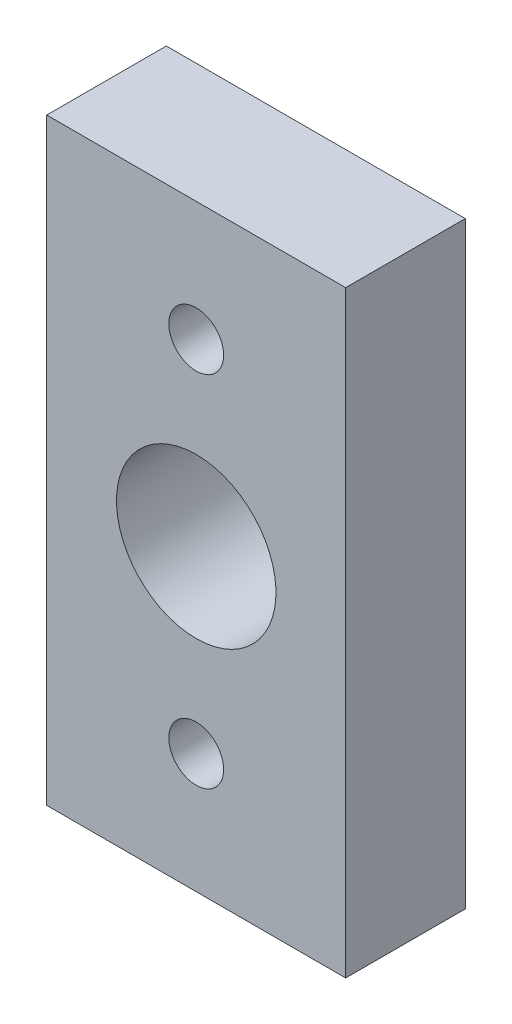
ISO-10303-21;
HEADER;
FILE_DESCRIPTION(('STEP AP214'),'2;1');
FILE_NAME('part.step','',(''),(''),'','','');
FILE_SCHEMA(('AUTOMOTIVE_DESIGN { 1 0 10303 214 1 1 1 1 }'));
ENDSEC;
DATA;
#1=APPLICATION_CONTEXT('core data for automotive mechanical design processes');
#2=APPLICATION_PROTOCOL_DEFINITION('international standard','automotive_design',2000,#1);
#3=PRODUCT_CONTEXT('',#1,'mechanical');
#4=PRODUCT('Part','Part','',(#3));
#5=PRODUCT_RELATED_PRODUCT_CATEGORY('part','',(#4));
#6=PRODUCT_DEFINITION_FORMATION('','',#4);
#7=PRODUCT_DEFINITION_CONTEXT('part definition',#1,'design');
#8=PRODUCT_DEFINITION('design','',#6,#7);
#9=PRODUCT_DEFINITION_SHAPE('','',#8);
#10=(LENGTH_UNIT() NAMED_UNIT(*) SI_UNIT(.MILLI.,.METRE.));
#11=(NAMED_UNIT(*) PLANE_ANGLE_UNIT() SI_UNIT($,.RADIAN.));
#12=(NAMED_UNIT(*) SI_UNIT($,.STERADIAN.) SOLID_ANGLE_UNIT());
#13=UNCERTAINTY_MEASURE_WITH_UNIT(LENGTH_MEASURE(1.E-05),#10,'distance_accuracy_value','');
#14=(GEOMETRIC_REPRESENTATION_CONTEXT(3) GLOBAL_UNCERTAINTY_ASSIGNED_CONTEXT((#13)) GLOBAL_UNIT_ASSIGNED_CONTEXT((#10,
#11,#12)) REPRESENTATION_CONTEXT('',''));
#15=CARTESIAN_POINT('',(0.,0.,0.));
#16=DIRECTION('',(0.,0.,1.));
#17=DIRECTION('',(1.,0.,0.));
#18=AXIS2_PLACEMENT_3D('',#15,#16,#17);
#19=CARTESIAN_POINT('',(15.,18.,-0.999999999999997));
#20=DIRECTION('',(0.,0.,-1.));
#21=DIRECTION('',(0.,1.,0.));
#22=AXIS2_PLACEMENT_3D('',#19,#20,#21);
#23=CYLINDRICAL_SURFACE('',#22,5.);
#24=CARTESIAN_POINT('',(15.,18.,-6.));
#25=DIRECTION('',(0.,0.,-1.));
#26=DIRECTION('',(0.,1.,0.));
#27=AXIS2_PLACEMENT_3D('',#24,#25,#26);
#28=CIRCLE('',#27,5.);
#29=CARTESIAN_POINT('',(15.,23.,-6.));
#30=VERTEX_POINT('',#29);
#31=EDGE_CURVE('E144',#30,#30,#28,.T.);
#32=ORIENTED_EDGE('',*,*,#31,.T.);
#33=EDGE_LOOP('',(#32));
#34=FACE_BOUND('',#33,.T.);
#35=CARTESIAN_POINT('',(15.,18.,-0.999999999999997));
#36=DIRECTION('',(0.,0.,-1.));
#37=DIRECTION('',(0.,1.,0.));
#38=AXIS2_PLACEMENT_3D('',#35,#36,#37);
#39=CIRCLE('',#38,5.);
#40=CARTESIAN_POINT('',(11.8057041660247,21.8466185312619,-0.999999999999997));
#41=VERTEX_POINT('',#40);
#42=CARTESIAN_POINT('',(10.0023531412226,18.1533814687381,-0.999999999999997));
#43=VERTEX_POINT('',#42);
#44=EDGE_CURVE('E121',#41,#43,#39,.T.);
#45=ORIENTED_EDGE('',*,*,#44,.F.);
#46=CARTESIAN_POINT('',(11.8057041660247,21.8466185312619,-0.999999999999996));
#47=CARTESIAN_POINT('',(11.7834305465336,21.8281239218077,-1.03414557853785));
#48=CARTESIAN_POINT('',(11.760610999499,21.8088454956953,-1.0674909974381));
#49=CARTESIAN_POINT('',(11.7141016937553,21.7687943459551,-1.13262108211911));
#50=CARTESIAN_POINT('',(11.6904122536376,21.7480221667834,-1.16440630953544));
#51=CARTESIAN_POINT('',(11.6183967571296,21.6835989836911,-1.2574521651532));
#52=CARTESIAN_POINT('',(11.5690759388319,21.6378022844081,-1.3164743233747));
#53=CARTESIAN_POINT('',(11.4688748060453,21.5406286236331,-1.42899049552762));
#54=CARTESIAN_POINT('',(11.4179879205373,21.4892248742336,-1.48245535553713));
#55=CARTESIAN_POINT('',(11.3158998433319,21.3812636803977,-1.58353477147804));
#56=CARTESIAN_POINT('',(11.2646985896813,21.3247051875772,-1.63114813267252));
#57=CARTESIAN_POINT('',(11.1213350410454,21.1584621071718,-1.7566977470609));
#58=CARTESIAN_POINT('',(11.029695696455,21.0429527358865,-1.82783578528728));
#59=CARTESIAN_POINT('',(10.8970401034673,20.8585797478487,-1.91767974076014));
#60=CARTESIAN_POINT('',(10.853666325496,20.7953447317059,-1.94479702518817));
#61=CARTESIAN_POINT('',(10.7689270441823,20.6653382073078,-1.99302030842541));
#62=CARTESIAN_POINT('',(10.7275607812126,20.5985680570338,-2.01412859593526));
#63=CARTESIAN_POINT('',(10.6380455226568,20.445991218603,-2.05393746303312));
#64=CARTESIAN_POINT('',(10.5905412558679,20.3593540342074,-2.07095136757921));
#65=CARTESIAN_POINT('',(10.5002481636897,20.1822279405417,-2.09398428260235));
#66=CARTESIAN_POINT('',(10.4574591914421,20.091739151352,-2.10000363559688));
#67=CARTESIAN_POINT('',(10.3709483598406,19.8935012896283,-2.09999577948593));
#68=CARTESIAN_POINT('',(10.328183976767,19.7853175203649,-2.09187463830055));
#69=CARTESIAN_POINT('',(10.251039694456,19.5686314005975,-2.0581395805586));
#70=CARTESIAN_POINT('',(10.2166603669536,19.4601290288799,-2.03252447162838));
#71=CARTESIAN_POINT('',(10.1565131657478,19.246199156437,-1.96327498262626));
#72=CARTESIAN_POINT('',(10.1307659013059,19.1407795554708,-1.91959802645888));
#73=CARTESIAN_POINT('',(10.0875033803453,18.9371386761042,-1.81478300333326));
#74=CARTESIAN_POINT('',(10.0699898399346,18.8389189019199,-1.7536413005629));
#75=CARTESIAN_POINT('',(10.0424888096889,18.6567186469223,-1.61803269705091));
#76=CARTESIAN_POINT('',(10.0322478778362,18.5723469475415,-1.54413953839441));
#77=CARTESIAN_POINT('',(10.0167440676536,18.416308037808,-1.38362432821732));
#78=CARTESIAN_POINT('',(10.0114755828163,18.3446265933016,-1.29701674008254));
#79=CARTESIAN_POINT('',(10.0065667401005,18.2572186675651,-1.1723252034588));
#80=CARTESIAN_POINT('',(10.005482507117,18.2350466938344,-1.13866923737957));
#81=CARTESIAN_POINT('',(10.0036705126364,18.1927109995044,-1.07019583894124));
#82=CARTESIAN_POINT('',(10.0029420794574,18.1725435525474,-1.03538072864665));
#83=CARTESIAN_POINT('',(10.0023531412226,18.1533814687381,-0.999999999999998));
#84=B_SPLINE_CURVE_WITH_KNOTS('',3,(#46,#47,#48,#49,#50,#51,#52,#53,#54,#55,#56,#57,#58,#59,#60,
#61,#62,#63,#64,#65,#66,#67,#68,#69,#70,#71,#72,#73,#74,#75,#76,#77,#78,#79,#80,#81,#82,#83),
.UNSPECIFIED.,.F.,.F.,(4,2,2,2,2,2,2,2,2,2,2,2,2,2,2,2,2,2,4),(0.,0.134259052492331,
0.268469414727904,0.536608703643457,0.806090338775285,1.07562690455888,1.56418087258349,
1.80793285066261,2.05159186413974,2.35161892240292,2.65163663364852,2.99992303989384,
3.34823318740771,3.69736910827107,4.04657776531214,4.3829242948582,4.7188911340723,
4.83979261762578,4.9604649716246),.UNSPECIFIED.);
#85=EDGE_CURVE('E21',#41,#43,#84,.T.);
#86=ORIENTED_EDGE('',*,*,#85,.T.);
#87=EDGE_LOOP('',(#45,#86));
#88=FACE_BOUND('',#87,.T.);
#89=ADVANCED_FACE('F17',(#34,#88),#23,.F.);
#90=CARTESIAN_POINT('',(15.,-18.,-1.));
#91=DIRECTION('',(0.,0.,-1.));
#92=DIRECTION('',(0.,1.,0.));
#93=AXIS2_PLACEMENT_3D('',#90,#91,#92);
#94=CYLINDRICAL_SURFACE('',#93,5.);
#95=CARTESIAN_POINT('',(15.,-18.,-6.));
#96=DIRECTION('',(0.,0.,-1.));
#97=DIRECTION('',(0.,1.,0.));
#98=AXIS2_PLACEMENT_3D('',#95,#96,#97);
#99=CIRCLE('',#98,5.);
#100=CARTESIAN_POINT('',(15.,-13.,-6.));
#101=VERTEX_POINT('',#100);
#102=EDGE_CURVE('E277',#101,#101,#99,.T.);
#103=ORIENTED_EDGE('',*,*,#102,.T.);
#104=EDGE_LOOP('',(#103));
#105=FACE_BOUND('',#104,.T.);
#106=CARTESIAN_POINT('',(15.,-18.,-1.));
#107=DIRECTION('',(0.,0.,-1.));
#108=DIRECTION('',(0.,1.,0.));
#109=AXIS2_PLACEMENT_3D('',#106,#107,#108);
#110=CIRCLE('',#109,5.);
#111=CARTESIAN_POINT('',(10.0023531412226,-18.1533814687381,-1.));
#112=VERTEX_POINT('',#111);
#113=CARTESIAN_POINT('',(11.8057041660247,-21.8466185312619,-1.));
#114=VERTEX_POINT('',#113);
#115=EDGE_CURVE('E370',#112,#114,#110,.T.);
#116=ORIENTED_EDGE('',*,*,#115,.F.);
#117=CARTESIAN_POINT('',(10.0023531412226,-18.1533814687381,-1.));
#118=CARTESIAN_POINT('',(10.0031940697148,-18.1807028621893,-1.05046474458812));
#119=CARTESIAN_POINT('',(10.0043182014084,-18.2101012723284,-1.09980010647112));
#120=CARTESIAN_POINT('',(10.0073494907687,-18.2728249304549,-1.19588974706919));
#121=CARTESIAN_POINT('',(10.0092567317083,-18.306150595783,-1.24264375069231));
#122=CARTESIAN_POINT('',(10.0140708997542,-18.3764975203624,-1.33323987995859));
#123=CARTESIAN_POINT('',(10.016977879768,-18.4135189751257,-1.37708185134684));
#124=CARTESIAN_POINT('',(10.024009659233,-18.4909536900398,-1.46152881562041));
#125=CARTESIAN_POINT('',(10.0281343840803,-18.5313667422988,-1.50213400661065));
#126=CARTESIAN_POINT('',(10.0426828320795,-18.6573701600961,-1.61877072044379));
#127=CARTESIAN_POINT('',(10.0552785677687,-18.7476835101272,-1.68957038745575));
#128=CARTESIAN_POINT('',(10.0877541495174,-18.9376045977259,-1.81501358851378));
#129=CARTESIAN_POINT('',(10.1076299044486,-19.0372070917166,-1.86966616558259));
#130=CARTESIAN_POINT('',(10.1551019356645,-19.2399872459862,-1.96073151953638));
#131=CARTESIAN_POINT('',(10.1825219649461,-19.3430410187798,-1.99751316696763));
#132=CARTESIAN_POINT('',(10.2454605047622,-19.5511739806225,-2.05430612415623));
#133=CARTESIAN_POINT('',(10.2809705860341,-19.656250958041,-2.07433478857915));
#134=CARTESIAN_POINT('',(10.3353654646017,-19.8008449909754,-2.09092796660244));
#135=CARTESIAN_POINT('',(10.3510331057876,-19.8409129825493,-2.09434711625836));
#136=CARTESIAN_POINT('',(10.3834345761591,-19.9207237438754,-2.09888349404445));
#137=CARTESIAN_POINT('',(10.4001678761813,-19.9604666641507,-2.10000185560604));
#138=CARTESIAN_POINT('',(10.474200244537,-20.1300699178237,-2.09999389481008));
#139=CARTESIAN_POINT('',(10.5366390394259,-20.2578710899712,-2.08786146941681));
#140=CARTESIAN_POINT('',(10.6704427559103,-20.5049631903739,-2.04228193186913));
#141=CARTESIAN_POINT('',(10.7418386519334,-20.6242222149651,-2.00875912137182));
#142=CARTESIAN_POINT('',(10.8901450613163,-20.8508398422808,-1.92369467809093));
#143=CARTESIAN_POINT('',(10.9670076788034,-20.9582848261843,-1.87229713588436));
#144=CARTESIAN_POINT('',(11.1240160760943,-21.1612000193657,-1.75369017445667));
#145=CARTESIAN_POINT('',(11.2041592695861,-21.2566794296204,-1.68649302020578));
#146=CARTESIAN_POINT('',(11.329524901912,-21.3959044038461,-1.5702542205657));
#147=CARTESIAN_POINT('',(11.3746492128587,-21.4439755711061,-1.52617308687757));
#148=CARTESIAN_POINT('',(11.4643905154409,-21.5360421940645,-1.43347117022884));
#149=CARTESIAN_POINT('',(11.5090076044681,-21.5800384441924,-1.38485127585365));
#150=CARTESIAN_POINT('',(11.5970226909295,-21.6637990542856,-1.28301646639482));
#151=CARTESIAN_POINT('',(11.6404203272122,-21.7035621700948,-1.22980020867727));
#152=CARTESIAN_POINT('',(11.7249953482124,-21.7785692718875,-1.11855252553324));
#153=CARTESIAN_POINT('',(11.7661708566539,-21.8138094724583,-1.06051713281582));
#154=CARTESIAN_POINT('',(11.8057041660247,-21.8466185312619,-1.));
#155=B_SPLINE_CURVE_WITH_KNOTS('',3,(#117,#118,#119,#120,#121,#122,#123,#124,#125,#126,#127,
#128,#129,#130,#131,#132,#133,#134,#135,#136,#137,#138,#139,#140,#141,#142,#143,#144,#145,#146,
#147,#148,#149,#150,#151,#152,#153,#154),.UNSPECIFIED.,.F.,.F.,(4,2,2,2,2,2,2,2,2,2,2,2,2,2,2,2,
2,2,4),(0.,0.172126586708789,0.344271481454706,0.516425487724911,0.688568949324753,
1.03305493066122,1.37734761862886,1.7141951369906,2.05069327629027,2.18010948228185,
2.30946191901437,2.73504859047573,3.16214978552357,3.58588494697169,4.00929224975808,
4.24702628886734,4.48471388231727,4.72247114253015,4.9604261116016),.UNSPECIFIED.);
#156=EDGE_CURVE('E125',#112,#114,#155,.T.);
#157=ORIENTED_EDGE('',*,*,#156,.T.);
#158=EDGE_LOOP('',(#116,#157));
#159=FACE_BOUND('',#158,.T.);
#160=ADVANCED_FACE('F279',(#105,#159),#94,.F.);
#161=CARTESIAN_POINT('',(0.,20.,0.));
#162=DIRECTION('',(-1.,0.,0.));
#163=DIRECTION('',(0.,0.,1.));
#164=AXIS2_PLACEMENT_3D('',#161,#162,#163);
#165=CYLINDRICAL_SURFACE('',#164,2.1);
#166=CARTESIAN_POINT('',(12.4000000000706,20.,0.));
#167=DIRECTION('',(-1.,0.,0.));
#168=DIRECTION('',(0.,0.,1.));
#169=AXIS2_PLACEMENT_3D('',#166,#167,#168);
#170=CIRCLE('',#169,2.09999999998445);
#171=CARTESIAN_POINT('',(12.4000000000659,21.8466185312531,-0.999999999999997));
#172=VERTEX_POINT('',#171);
#173=CARTESIAN_POINT('',(12.4000000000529,20.,2.09999999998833));
#174=VERTEX_POINT('',#173);
#175=EDGE_CURVE('E155',#172,#174,#170,.F.);
#176=ORIENTED_EDGE('',*,*,#175,.T.);
#177=CARTESIAN_POINT('',(12.4000000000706,20.,0.));
#178=DIRECTION('',(-1.,0.,0.));
#179=DIRECTION('',(0.,0.,1.));
#180=AXIS2_PLACEMENT_3D('',#177,#178,#179);
#181=CIRCLE('',#180,2.09999999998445);
#182=CARTESIAN_POINT('',(12.4000000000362,18.8958236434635,1.78627953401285));
#183=VERTEX_POINT('',#182);
#184=EDGE_CURVE('E346',#174,#183,#181,.F.);
#185=ORIENTED_EDGE('',*,*,#184,.T.);
#186=CARTESIAN_POINT('',(12.4000000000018,18.8958236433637,1.78627953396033));
#187=CARTESIAN_POINT('',(12.3847910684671,18.8517040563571,1.75902403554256));
#188=CARTESIAN_POINT('',(12.3710813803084,18.8082457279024,1.72988584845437));
#189=CARTESIAN_POINT('',(12.3464169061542,18.7231509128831,1.66805433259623));
#190=CARTESIAN_POINT('',(12.3354605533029,18.6815134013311,1.63536304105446));
#191=CARTESIAN_POINT('',(12.3160643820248,18.600599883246,1.56668189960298));
#192=CARTESIAN_POINT('',(12.3076189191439,18.5613187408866,1.53069968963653));
#193=CARTESIAN_POINT('',(12.2929040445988,18.4854131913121,1.45563715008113));
#194=CARTESIAN_POINT('',(12.2866347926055,18.4487889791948,1.41655659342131));
#195=CARTESIAN_POINT('',(12.2706198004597,18.3435343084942,1.29520218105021));
#196=CARTESIAN_POINT('',(12.2636240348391,18.2793272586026,1.20865080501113));
#197=CARTESIAN_POINT('',(12.2543497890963,18.1649575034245,1.0267214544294));
#198=CARTESIAN_POINT('',(12.2520637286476,18.1147723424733,0.931357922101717));
#199=CARTESIAN_POINT('',(12.2505915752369,18.0586024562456,0.801345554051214));
#200=CARTESIAN_POINT('',(12.2503545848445,18.0457811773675,0.769547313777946));
#201=CARTESIAN_POINT('',(12.2500594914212,18.0217071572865,0.705360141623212));
#202=CARTESIAN_POINT('',(12.2500014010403,18.0104545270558,0.672971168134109));
#203=CARTESIAN_POINT('',(12.2499951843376,17.9640656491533,0.528057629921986));
#204=CARTESIAN_POINT('',(12.2506601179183,17.9375603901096,0.412615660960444));
#205=CARTESIAN_POINT('',(12.2516142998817,17.9042831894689,0.178768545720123));
#206=CARTESIAN_POINT('',(12.2519028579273,17.8975474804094,0.0603583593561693));
#207=CARTESIAN_POINT('',(12.251695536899,17.9035116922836,-0.156605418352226));
#208=CARTESIAN_POINT('',(12.2513198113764,17.913223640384,-0.255250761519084));
#209=CARTESIAN_POINT('',(12.2504712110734,17.9464266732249,-0.450089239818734));
#210=CARTESIAN_POINT('',(12.2499984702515,17.9698988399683,-0.546285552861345));
#211=CARTESIAN_POINT('',(12.2500010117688,18.0199087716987,-0.702501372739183));
#212=CARTESIAN_POINT('',(12.2502094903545,18.0427173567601,-0.763741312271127));
#213=CARTESIAN_POINT('',(12.2514879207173,18.0939159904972,-0.883801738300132));
#214=CARTESIAN_POINT('',(12.252557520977,18.1223037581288,-0.942623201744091));
#215=CARTESIAN_POINT('',(12.2542807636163,18.1533814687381,-0.999999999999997));
#216=B_SPLINE_CURVE_WITH_KNOTS('',3,(#186,#187,#188,#189,#190,#191,#192,#193,#194,#195,#196,
#197,#198,#199,#200,#201,#202,#203,#204,#205,#206,#207,#208,#209,#210,#211,#212,#213,#214,#215),
.UNSPECIFIED.,.F.,.F.,(4,2,2,2,2,2,2,2,2,2,2,2,2,2,4),(0.,0.162056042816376,0.324019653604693,
0.485616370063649,0.647224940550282,0.969676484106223,1.29160863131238,1.39443809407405,
1.49727482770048,1.85074574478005,2.20486408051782,2.50128318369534,2.79729571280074,
2.99307706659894,3.18877854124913),.UNSPECIFIED.);
#217=CARTESIAN_POINT('',(12.2542807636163,18.1533814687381,-0.999999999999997));
#218=VERTEX_POINT('',#217);
#219=EDGE_CURVE('E141',#183,#218,#216,.T.);
#220=ORIENTED_EDGE('',*,*,#219,.T.);
#221=DIRECTION('',(1.,0.,0.));
#222=VECTOR('',#221,1.);
#223=CARTESIAN_POINT('',(15.,18.1533814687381,-0.999999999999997));
#224=LINE('',#223,#222);
#225=EDGE_CURVE('E130',#43,#218,#224,.T.);
#226=ORIENTED_EDGE('',*,*,#225,.F.);
#227=ORIENTED_EDGE('',*,*,#85,.F.);
#228=DIRECTION('',(1.,0.,0.));
#229=VECTOR('',#228,1.);
#230=CARTESIAN_POINT('',(15.,21.8466185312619,-0.999999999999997));
#231=LINE('',#230,#229);
#232=EDGE_CURVE('E133',#172,#41,#231,.F.);
#233=ORIENTED_EDGE('',*,*,#232,.F.);
#234=EDGE_LOOP('',(#176,#185,#220,#226,#227,#233));
#235=FACE_BOUND('',#234,.T.);
#236=CARTESIAN_POINT('',(0.,20.,0.));
#237=DIRECTION('',(-1.,0.,0.));
#238=DIRECTION('',(0.,0.,1.));
#239=AXIS2_PLACEMENT_3D('',#236,#237,#238);
#240=CIRCLE('',#239,2.1);
#241=CARTESIAN_POINT('',(0.,20.,2.09999999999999));
#242=VERTEX_POINT('',#241);
#243=EDGE_CURVE('E323',#242,#242,#240,.T.);
#244=ORIENTED_EDGE('',*,*,#243,.T.);
#245=EDGE_LOOP('',(#244));
#246=FACE_BOUND('',#245,.T.);
#247=ADVANCED_FACE('F137',(#235,#246),#165,.F.);
#248=CARTESIAN_POINT('',(0.,-20.,0.));
#249=DIRECTION('',(-1.,0.,0.));
#250=DIRECTION('',(0.,0.,1.));
#251=AXIS2_PLACEMENT_3D('',#248,#249,#250);
#252=CYLINDRICAL_SURFACE('',#251,2.1);
#253=CARTESIAN_POINT('',(12.4000000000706,-20.,0.));
#254=DIRECTION('',(-1.,0.,0.));
#255=DIRECTION('',(0.,0.,1.));
#256=AXIS2_PLACEMENT_3D('',#253,#254,#255);
#257=CIRCLE('',#256,2.09999999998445);
#258=CARTESIAN_POINT('',(12.4000000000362,-18.8958236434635,1.78627953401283));
#259=VERTEX_POINT('',#258);
#260=CARTESIAN_POINT('',(12.4000000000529,-20.,2.09999999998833));
#261=VERTEX_POINT('',#260);
#262=EDGE_CURVE('E352',#259,#261,#257,.F.);
#263=ORIENTED_EDGE('',*,*,#262,.T.);
#264=CARTESIAN_POINT('',(12.4000000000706,-20.,0.));
#265=DIRECTION('',(-1.,0.,0.));
#266=DIRECTION('',(0.,0.,1.));
#267=AXIS2_PLACEMENT_3D('',#264,#265,#266);
#268=CIRCLE('',#267,2.09999999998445);
#269=CARTESIAN_POINT('',(12.4000000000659,-21.8466185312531,-1.));
#270=VERTEX_POINT('',#269);
#271=EDGE_CURVE('E148',#261,#270,#268,.F.);
#272=ORIENTED_EDGE('',*,*,#271,.T.);
#273=DIRECTION('',(1.,0.,0.));
#274=VECTOR('',#273,1.);
#275=CARTESIAN_POINT('',(15.,-21.8466185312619,-1.));
#276=LINE('',#275,#274);
#277=EDGE_CURVE('E371',#114,#270,#276,.T.);
#278=ORIENTED_EDGE('',*,*,#277,.F.);
#279=ORIENTED_EDGE('',*,*,#156,.F.);
#280=DIRECTION('',(1.,0.,0.));
#281=VECTOR('',#280,1.);
#282=CARTESIAN_POINT('',(15.,-18.1533814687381,-1.));
#283=LINE('',#282,#281);
#284=CARTESIAN_POINT('',(12.2542807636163,-18.1533814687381,-1.));
#285=VERTEX_POINT('',#284);
#286=EDGE_CURVE('E367',#285,#112,#283,.F.);
#287=ORIENTED_EDGE('',*,*,#286,.F.);
#288=CARTESIAN_POINT('',(12.2542807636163,-18.1533814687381,-1.));
#289=CARTESIAN_POINT('',(12.2525574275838,-18.1223281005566,-0.942662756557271));
#290=CARTESIAN_POINT('',(12.2514888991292,-18.0939614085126,-0.883893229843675));
#291=CARTESIAN_POINT('',(12.2502105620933,-18.0427544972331,-0.763843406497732));
#292=CARTESIAN_POINT('',(12.2500024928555,-18.0199255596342,-0.702558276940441));
#293=CARTESIAN_POINT('',(12.2499954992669,-17.9640253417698,-0.527930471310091));
#294=CARTESIAN_POINT('',(12.2506611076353,-17.9375147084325,-0.412416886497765));
#295=CARTESIAN_POINT('',(12.2516148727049,-17.9042746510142,-0.178585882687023));
#296=CARTESIAN_POINT('',(12.2519029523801,-17.8975492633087,-0.0602678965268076));
#297=CARTESIAN_POINT('',(12.2516954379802,-17.9035107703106,0.156550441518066));
#298=CARTESIAN_POINT('',(12.251319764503,-17.913216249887,0.255141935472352));
#299=CARTESIAN_POINT('',(12.2504722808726,-17.9463939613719,0.449962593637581));
#300=CARTESIAN_POINT('',(12.2500004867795,-17.9698638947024,0.546192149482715));
#301=CARTESIAN_POINT('',(12.249999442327,-18.0345250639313,0.748140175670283));
#302=CARTESIAN_POINT('',(12.2506174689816,-18.0777993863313,0.853199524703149));
#303=CARTESIAN_POINT('',(12.2554608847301,-18.1807058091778,1.05499770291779));
#304=CARTESIAN_POINT('',(12.2596894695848,-18.2403523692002,1.15172907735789));
#305=CARTESIAN_POINT('',(12.2747911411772,-18.3745440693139,1.33444745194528));
#306=CARTESIAN_POINT('',(12.2856913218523,-18.4491491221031,1.42038890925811));
#307=CARTESIAN_POINT('',(12.3093475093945,-18.5697080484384,1.53865208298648));
#308=CARTESIAN_POINT('',(12.3184410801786,-18.6113020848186,1.57627425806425));
#309=CARTESIAN_POINT('',(12.3394127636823,-18.696931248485,1.64775927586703));
#310=CARTESIAN_POINT('',(12.3512888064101,-18.7409645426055,1.68162488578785));
#311=CARTESIAN_POINT('',(12.3700805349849,-18.8039771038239,1.72627351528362));
#312=CARTESIAN_POINT('',(12.3757091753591,-18.822173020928,1.73873734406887));
#313=CARTESIAN_POINT('',(12.3874712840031,-18.8588151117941,1.76300278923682));
#314=CARTESIAN_POINT('',(12.3936042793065,-18.877261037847,1.77480500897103));
#315=CARTESIAN_POINT('',(12.4000000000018,-18.8958236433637,1.78627953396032));
#316=B_SPLINE_CURVE_WITH_KNOTS('',3,(#288,#289,#290,#291,#292,#293,#294,#295,#296,#297,#298,
#299,#300,#301,#302,#303,#304,#305,#306,#307,#308,#309,#310,#311,#312,#313,#314,#315),
.UNSPECIFIED.,.F.,.F.,(4,2,2,2,2,2,2,2,2,2,2,2,2,4),(0.,0.195543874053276,0.391482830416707,
0.74524137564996,1.09907208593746,1.39531263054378,1.69150371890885,2.03083145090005,
2.37045983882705,2.71147672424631,2.88173194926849,3.05186091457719,3.12013472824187,
3.18834523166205),.UNSPECIFIED.);
#317=EDGE_CURVE('E200',#285,#259,#316,.T.);
#318=ORIENTED_EDGE('',*,*,#317,.T.);
#319=EDGE_LOOP('',(#263,#272,#278,#279,#287,#318));
#320=FACE_BOUND('',#319,.T.);
#321=CARTESIAN_POINT('',(0.,-20.,0.));
#322=DIRECTION('',(-1.,0.,0.));
#323=DIRECTION('',(0.,0.,1.));
#324=AXIS2_PLACEMENT_3D('',#321,#322,#323);
#325=CIRCLE('',#324,2.1);
#326=CARTESIAN_POINT('',(0.,-20.,2.09999999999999));
#327=VERTEX_POINT('',#326);
#328=EDGE_CURVE('E326',#327,#327,#325,.T.);
#329=ORIENTED_EDGE('',*,*,#328,.T.);
#330=EDGE_LOOP('',(#329));
#331=FACE_BOUND('',#330,.T.);
#332=ADVANCED_FACE('F266',(#320,#331),#252,.F.);
#333=CARTESIAN_POINT('',(30.,30.,-6.));
#334=DIRECTION('',(0.,0.,1.));
#335=DIRECTION('',(0.,-1.,0.));
#336=AXIS2_PLACEMENT_3D('',#333,#334,#335);
#337=PLANE('',#336);
#338=DIRECTION('',(1.,0.,0.));
#339=VECTOR('',#338,1.);
#340=CARTESIAN_POINT('',(30.,30.,-6.));
#341=LINE('',#340,#339);
#342=CARTESIAN_POINT('',(0.,30.,-6.));
#343=VERTEX_POINT('',#342);
#344=CARTESIAN_POINT('',(30.,30.,-6.));
#345=VERTEX_POINT('',#344);
#346=EDGE_CURVE('E317',#343,#345,#341,.T.);
#347=ORIENTED_EDGE('',*,*,#346,.T.);
#348=DIRECTION('',(0.,1.,0.));
#349=VECTOR('',#348,1.);
#350=CARTESIAN_POINT('',(30.,0.,-6.));
#351=LINE('',#350,#349);
#352=CARTESIAN_POINT('',(30.,-30.,-6.));
#353=VERTEX_POINT('',#352);
#354=EDGE_CURVE('E319',#353,#345,#351,.T.);
#355=ORIENTED_EDGE('',*,*,#354,.F.);
#356=DIRECTION('',(1.,0.,0.));
#357=VECTOR('',#356,1.);
#358=CARTESIAN_POINT('',(30.,-30.,-6.));
#359=LINE('',#358,#357);
#360=CARTESIAN_POINT('',(0.,-30.,-6.));
#361=VERTEX_POINT('',#360);
#362=EDGE_CURVE('E327',#353,#361,#359,.F.);
#363=ORIENTED_EDGE('',*,*,#362,.T.);
#364=DIRECTION('',(0.,1.,0.));
#365=VECTOR('',#364,1.);
#366=CARTESIAN_POINT('',(0.,0.,-6.));
#367=LINE('',#366,#365);
#368=EDGE_CURVE('E333',#361,#343,#367,.T.);
#369=ORIENTED_EDGE('',*,*,#368,.T.);
#370=EDGE_LOOP('',(#347,#355,#363,#369));
#371=FACE_BOUND('',#370,.T.);
#372=ORIENTED_EDGE('',*,*,#31,.F.);
#373=EDGE_LOOP('',(#372));
#374=FACE_BOUND('',#373,.T.);
#375=ORIENTED_EDGE('',*,*,#102,.F.);
#376=EDGE_LOOP('',(#375));
#377=FACE_BOUND('',#376,.T.);
#378=CARTESIAN_POINT('',(15.,0.,-6.));
#379=DIRECTION('',(0.,0.,-1.));
#380=DIRECTION('',(0.,1.,0.));
#381=AXIS2_PLACEMENT_3D('',#378,#379,#380);
#382=CIRCLE('',#381,8.);
#383=CARTESIAN_POINT('',(15.,8.,-6.));
#384=VERTEX_POINT('',#383);
#385=EDGE_CURVE('E315',#384,#384,#382,.F.);
#386=ORIENTED_EDGE('',*,*,#385,.T.);
#387=EDGE_LOOP('',(#386));
#388=FACE_BOUND('',#387,.T.);
#389=ADVANCED_FACE('F263',(#371,#374,#377,#388),#337,.F.);
#390=CARTESIAN_POINT('',(15.,18.,-0.999999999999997));
#391=DIRECTION('',(0.,0.,-1.));
#392=DIRECTION('',(0.,1.,0.));
#393=AXIS2_PLACEMENT_3D('',#390,#391,#392);
#394=PLANE('',#393);
#395=ORIENTED_EDGE('',*,*,#232,.T.);
#396=ORIENTED_EDGE('',*,*,#44,.T.);
#397=ORIENTED_EDGE('',*,*,#225,.T.);
#398=CARTESIAN_POINT('',(15.,18.,-0.999999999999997));
#399=DIRECTION('',(0.,0.,1.));
#400=DIRECTION('',(1.,0.,0.));
#401=AXIS2_PLACEMENT_3D('',#398,#399,#400);
#402=CIRCLE('',#401,2.75);
#403=CARTESIAN_POINT('',(13.0601733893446,19.9492493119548,-0.999999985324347));
#404=VERTEX_POINT('',#403);
#405=EDGE_CURVE('E331',#218,#404,#402,.T.);
#406=ORIENTED_EDGE('',*,*,#405,.T.);
#407=CARTESIAN_POINT('',(13.0601733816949,19.9492493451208,-1.00000000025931));
#408=CARTESIAN_POINT('',(13.0604310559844,19.9577058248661,-1.00000000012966));
#409=CARTESIAN_POINT('',(13.0606243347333,19.9661632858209,-1.00000000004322));
#410=CARTESIAN_POINT('',(13.0608821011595,19.9830801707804,-0.999999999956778));
#411=CARTESIAN_POINT('',(13.0609465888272,19.9915395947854,-0.999999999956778));
#412=CARTESIAN_POINT('',(13.0609466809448,20.,-0.999999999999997));
#413=B_SPLINE_CURVE_WITH_KNOTS('',3,(#407,#408,#409,#410,#411,#412),.UNSPECIFIED.,.F.,.F.,(4,2,
4),(0.,0.0253790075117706,0.0507580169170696),.UNSPECIFIED.);
#414=CARTESIAN_POINT('',(13.0609466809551,20.,-0.999999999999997));
#415=VERTEX_POINT('',#414);
#416=EDGE_CURVE('E134',#404,#415,#413,.T.);
#417=ORIENTED_EDGE('',*,*,#416,.T.);
#418=CARTESIAN_POINT('',(13.0609466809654,20.,-0.999999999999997));
#419=CARTESIAN_POINT('',(13.0609921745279,20.0458391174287,-0.999999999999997));
#420=CARTESIAN_POINT('',(13.0590528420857,20.0916511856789,-0.999999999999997));
#421=CARTESIAN_POINT('',(13.0515717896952,20.1828832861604,-0.999999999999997));
#422=CARTESIAN_POINT('',(13.046037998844,20.2283039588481,-0.999999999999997));
#423=CARTESIAN_POINT('',(13.0318002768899,20.3181899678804,-0.999999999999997));
#424=CARTESIAN_POINT('',(13.0231269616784,20.3626602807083,-0.999999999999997));
#425=CARTESIAN_POINT('',(13.0031215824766,20.4510085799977,-0.999999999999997));
#426=CARTESIAN_POINT('',(12.9917883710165,20.4948863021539,-0.999999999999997));
#427=CARTESIAN_POINT('',(12.9632578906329,20.5950500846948,-0.999999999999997));
#428=CARTESIAN_POINT('',(12.9453204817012,20.6511233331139,-0.999999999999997));
#429=CARTESIAN_POINT('',(12.906751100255,20.7623437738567,-0.999999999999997));
#430=CARTESIAN_POINT('',(12.886118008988,20.817490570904,-0.999999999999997));
#431=CARTESIAN_POINT('',(12.8428217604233,20.9271108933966,-0.999999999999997));
#432=CARTESIAN_POINT('',(12.8201543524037,20.9815827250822,-0.999999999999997));
#433=CARTESIAN_POINT('',(12.7733377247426,21.0898870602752,-0.999999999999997));
#434=CARTESIAN_POINT('',(12.7491883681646,21.1437195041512,-0.999999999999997));
#435=CARTESIAN_POINT('',(12.6990697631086,21.2523969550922,-0.999999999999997));
#436=CARTESIAN_POINT('',(12.6730682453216,21.3072270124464,-0.999999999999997));
#437=CARTESIAN_POINT('',(12.6201669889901,21.4164549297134,-0.999999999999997));
#438=CARTESIAN_POINT('',(12.5932671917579,21.4708527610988,-0.999999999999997));
#439=CARTESIAN_POINT('',(12.5389402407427,21.5789735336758,-0.999999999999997));
#440=CARTESIAN_POINT('',(12.511517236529,21.6326985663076,-0.999999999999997));
#441=CARTESIAN_POINT('',(12.45613062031,21.7398583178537,-0.999999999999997));
#442=CARTESIAN_POINT('',(12.4281670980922,21.7932930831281,-0.999999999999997));
#443=CARTESIAN_POINT('',(12.4000000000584,21.8466185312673,-0.999999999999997));
#444=B_SPLINE_CURVE_WITH_KNOTS('',3,(#418,#419,#420,#421,#422,#423,#424,#425,#426,#427,#428,
#429,#430,#431,#432,#433,#434,#435,#436,#437,#438,#439,#440,#441,#442,#443),.UNSPECIFIED.,.F.,
.F.,(4,2,2,2,2,2,2,2,2,2,2,2,4),(0.,0.137433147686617,0.274564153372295,0.410392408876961,
0.546279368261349,0.722798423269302,0.899390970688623,1.07636150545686,1.2533484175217,
1.43538653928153,1.61743657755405,1.79839066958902,1.97931495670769),.UNSPECIFIED.);
#445=EDGE_CURVE('E158',#415,#172,#444,.T.);
#446=ORIENTED_EDGE('',*,*,#445,.T.);
#447=EDGE_LOOP('',(#395,#396,#397,#406,#417,#446));
#448=FACE_BOUND('',#447,.T.);
#449=ADVANCED_FACE('F128',(#448),#394,.T.);
#450=CARTESIAN_POINT('',(13.0598591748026,20.,0.));
#451=DIRECTION('',(-1.,0.,0.));
#452=DIRECTION('',(0.,-1.,0.));
#453=AXIS2_PLACEMENT_3D('',#450,#451,#452);
#454=CONICAL_SURFACE('',#453,1.00180991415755,1.02974425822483);
#455=DIRECTION('',(0.515038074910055,0.,0.857167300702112));
#456=VECTOR('',#455,1.);
#457=CARTESIAN_POINT('',(-299815.787087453,20.0000000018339,-499000.));
#458=LINE('',#457,#456);
#459=CARTESIAN_POINT('',(13.1125413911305,20.0000000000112,-0.914131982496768));
#460=VERTEX_POINT('',#459);
#461=EDGE_CURVE('E157',#460,#415,#458,.F.);
#462=ORIENTED_EDGE('',*,*,#461,.T.);
#463=ORIENTED_EDGE('',*,*,#416,.F.);
#464=CARTESIAN_POINT('',(13.0601733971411,19.9492492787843,-0.999999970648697));
#465=CARTESIAN_POINT('',(13.0689290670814,19.9579589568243,-0.985854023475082));
#466=CARTESIAN_POINT('',(13.0776708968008,19.9665430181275,-0.97162539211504));
#467=CARTESIAN_POINT('',(13.0951268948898,19.9834599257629,-0.943002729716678));
#468=CARTESIAN_POINT('',(13.1038410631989,19.9917927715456,-0.928608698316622));
#469=CARTESIAN_POINT('',(13.1125413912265,20.0000000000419,-0.914131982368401));
#470=B_SPLINE_CURVE_WITH_KNOTS('',3,(#464,#465,#466,#467,#468,#469),.UNSPECIFIED.,.F.,.F.,(4,2,
4),(0.,0.0563297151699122,0.112659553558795),.UNSPECIFIED.);
#471=EDGE_CURVE('E332',#404,#460,#470,.T.);
#472=ORIENTED_EDGE('',*,*,#471,.T.);
#473=EDGE_LOOP('',(#462,#463,#472));
#474=FACE_BOUND('',#473,.T.);
#475=ADVANCED_FACE('F236',(#474),#454,.F.);
#476=CARTESIAN_POINT('',(12.4000000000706,20.,0.));
#477=DIRECTION('',(-1.,0.,0.));
#478=DIRECTION('',(0.,0.,1.));
#479=AXIS2_PLACEMENT_3D('',#476,#477,#478);
#480=CONICAL_SURFACE('',#479,2.09999999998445,1.02974425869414);
#481=CARTESIAN_POINT('',(13.1125413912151,20.0000000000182,-0.914131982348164));
#482=CARTESIAN_POINT('',(13.1332503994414,20.0195461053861,-0.879637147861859));
#483=CARTESIAN_POINT('',(13.1538800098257,20.0384041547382,-0.844702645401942));
#484=CARTESIAN_POINT('',(13.1948175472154,20.0747443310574,-0.77388174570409));
#485=CARTESIAN_POINT('',(13.2151251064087,20.0922249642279,-0.737994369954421));
#486=CARTESIAN_POINT('',(13.2555654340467,20.1260655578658,-0.664624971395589));
#487=CARTESIAN_POINT('',(13.2756887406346,20.1424001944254,-0.627125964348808));
#488=CARTESIAN_POINT('',(13.3150195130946,20.1734693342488,-0.55102654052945));
#489=CARTESIAN_POINT('',(13.3342274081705,20.1882045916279,-0.512426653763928));
#490=CARTESIAN_POINT('',(13.3732204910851,20.2173720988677,-0.429442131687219));
#491=CARTESIAN_POINT('',(13.392830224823,20.2315863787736,-0.384893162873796));
#492=CARTESIAN_POINT('',(13.4195637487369,20.250520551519,-0.31640268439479));
#493=CARTESIAN_POINT('',(13.4280208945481,20.2564293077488,-0.293318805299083));
#494=CARTESIAN_POINT('',(13.4436814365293,20.2672587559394,-0.246512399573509));
#495=CARTESIAN_POINT('',(13.4508853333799,20.2721798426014,-0.222790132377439));
#496=CARTESIAN_POINT('',(13.4662033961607,20.2825615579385,-0.164626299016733));
#497=CARTESIAN_POINT('',(13.4734566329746,20.2873999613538,-0.129818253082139));
#498=CARTESIAN_POINT('',(13.4805818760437,20.2921335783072,-0.0769646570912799));
#499=CARTESIAN_POINT('',(13.4823314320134,20.2932909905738,-0.0592792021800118));
#500=CARTESIAN_POINT('',(13.4844710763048,20.2947056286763,-0.0237872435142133));
#501=CARTESIAN_POINT('',(13.484861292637,20.2949629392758,-0.00598075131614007));
#502=CARTESIAN_POINT('',(13.4842483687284,20.2945581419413,0.0296312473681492));
#503=CARTESIAN_POINT('',(13.4832425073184,20.2938942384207,0.047436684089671));
#504=CARTESIAN_POINT('',(13.4799122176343,20.291688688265,0.0828699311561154));
#505=CARTESIAN_POINT('',(13.4775874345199,20.2901468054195,0.100497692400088));
#506=CARTESIAN_POINT('',(13.4717643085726,20.28626502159,0.135566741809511));
#507=CARTESIAN_POINT('',(13.468259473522,20.2839207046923,0.153006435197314));
#508=CARTESIAN_POINT('',(13.4602723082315,20.2785438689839,0.187547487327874));
#509=CARTESIAN_POINT('',(13.4557899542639,20.2755113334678,0.204648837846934));
#510=CARTESIAN_POINT('',(13.4378731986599,20.2632950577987,0.266924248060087));
#511=CARTESIAN_POINT('',(13.422038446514,20.2523284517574,0.311050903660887));
#512=CARTESIAN_POINT('',(13.3874136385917,20.2276719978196,0.39735530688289));
#513=CARTESIAN_POINT('',(13.3686161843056,20.2139753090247,0.439527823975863));
#514=CARTESIAN_POINT('',(13.3293147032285,20.1844720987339,0.522538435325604));
#515=CARTESIAN_POINT('',(13.3088039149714,20.1686570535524,0.563370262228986));
#516=CARTESIAN_POINT('',(13.2668311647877,20.1352626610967,0.643806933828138));
#517=CARTESIAN_POINT('',(13.2453689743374,20.1176828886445,0.683411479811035));
#518=CARTESIAN_POINT('',(13.2053400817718,20.0838113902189,0.755310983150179));
#519=CARTESIAN_POINT('',(13.1868563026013,20.0677600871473,0.78776595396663));
#520=CARTESIAN_POINT('',(13.149783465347,20.0346528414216,0.851640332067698));
#521=CARTESIAN_POINT('',(13.131196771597,20.0176070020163,0.883066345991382));
#522=CARTESIAN_POINT('',(13.1125413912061,20.0000000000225,0.914131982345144));
#523=B_SPLINE_CURVE_WITH_KNOTS('',3,(#481,#482,#483,#484,#485,#486,#487,#488,#489,#490,#491,
#492,#493,#494,#495,#496,#497,#498,#499,#500,#501,#502,#503,#504,#505,#506,#507,#508,#509,#510,
#511,#512,#513,#514,#515,#516,#517,#518,#519,#520,#521,#522),.UNSPECIFIED.,.F.,.F.,(4,2,2,2,2,2,
2,2,2,2,2,2,2,2,2,2,2,2,2,2,4),(0.,0.134185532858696,0.268514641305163,0.405222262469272,
0.541865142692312,0.693781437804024,0.769586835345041,0.845361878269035,0.952553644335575,
1.00591686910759,1.0592750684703,1.11273741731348,1.1662141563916,1.21999004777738,
1.27376724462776,1.41778516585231,1.56216860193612,1.70715150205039,1.85216941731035,
1.97410294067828,2.09496161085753),.UNSPECIFIED.);
#524=CARTESIAN_POINT('',(13.1125413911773,20.0000000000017,0.914131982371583));
#525=VERTEX_POINT('',#524);
#526=EDGE_CURVE('E241',#460,#525,#523,.T.);
#527=ORIENTED_EDGE('',*,*,#526,.T.);
#528=DIRECTION('',(0.515038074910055,0.,-0.857167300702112));
#529=VECTOR('',#528,1.);
#530=CARTESIAN_POINT('',(-299815.787087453,20.,499000.));
#531=LINE('',#530,#529);
#532=EDGE_CURVE('E347',#525,#174,#531,.F.);
#533=ORIENTED_EDGE('',*,*,#532,.T.);
#534=ORIENTED_EDGE('',*,*,#175,.F.);
#535=ORIENTED_EDGE('',*,*,#445,.F.);
#536=ORIENTED_EDGE('',*,*,#461,.F.);
#537=EDGE_LOOP('',(#527,#533,#534,#535,#536));
#538=FACE_BOUND('',#537,.T.);
#539=ADVANCED_FACE('F231',(#538),#480,.F.);
#540=CARTESIAN_POINT('',(12.4000000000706,20.,0.));
#541=DIRECTION('',(-1.,0.,0.));
#542=DIRECTION('',(0.,0.,1.));
#543=AXIS2_PLACEMENT_3D('',#540,#541,#542);
#544=CONICAL_SURFACE('',#543,2.09999999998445,1.02974425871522);
#545=CARTESIAN_POINT('',(13.1125413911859,20.0000000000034,0.914131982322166));
#546=CARTESIAN_POINT('',(13.0936568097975,19.9821774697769,0.945553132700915));
#547=CARTESIAN_POINT('',(13.0746957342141,19.9637784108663,0.976597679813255));
#548=CARTESIAN_POINT('',(13.0366754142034,19.9257672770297,1.03788839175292));
#549=CARTESIAN_POINT('',(13.0176161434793,19.9061548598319,1.06813432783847));
#550=CARTESIAN_POINT('',(12.9601011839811,19.8451172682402,1.1580305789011));
#551=CARTESIAN_POINT('',(12.9215956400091,19.8017593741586,1.21636261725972));
#552=CARTESIAN_POINT('',(12.8432385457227,19.7072829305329,1.3310039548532));
#553=CARTESIAN_POINT('',(12.8034014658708,19.6559085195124,1.38711432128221));
#554=CARTESIAN_POINT('',(12.7247804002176,19.5460975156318,1.49246174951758));
#555=CARTESIAN_POINT('',(12.6859931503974,19.4876869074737,1.54172273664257));
#556=CARTESIAN_POINT('',(12.6186527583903,19.376560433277,1.62065343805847));
#557=CARTESIAN_POINT('',(12.5897356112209,19.3254485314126,1.65224580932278));
#558=CARTESIAN_POINT('',(12.5340288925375,19.218628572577,1.70698336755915));
#559=CARTESIAN_POINT('',(12.5072171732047,19.16298625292,1.73022959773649));
#560=CARTESIAN_POINT('',(12.4671511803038,19.0716829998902,1.75839553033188));
#561=CARTESIAN_POINT('',(12.4529639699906,19.0375392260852,1.76690726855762));
#562=CARTESIAN_POINT('',(12.4256087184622,18.9676995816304,1.77986389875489));
#563=CARTESIAN_POINT('',(12.4124521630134,18.9319916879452,1.78426767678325));
#564=CARTESIAN_POINT('',(12.4000000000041,18.8958236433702,1.78627953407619));
#565=B_SPLINE_CURVE_WITH_KNOTS('',3,(#545,#546,#547,#548,#549,#550,#551,#552,#553,#554,#555,
#556,#557,#558,#559,#560,#561,#562,#563,#564),.UNSPECIFIED.,.F.,.F.,(4,2,2,2,2,2,2,2,2,4),(0.,
0.122273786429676,0.244582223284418,0.491047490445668,0.748253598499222,1.00453739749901,
1.20405949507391,1.40107740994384,1.5146604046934,1.62936835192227),.UNSPECIFIED.);
#566=EDGE_CURVE('E215',#525,#183,#565,.T.);
#567=ORIENTED_EDGE('',*,*,#566,.T.);
#568=ORIENTED_EDGE('',*,*,#184,.F.);
#569=ORIENTED_EDGE('',*,*,#532,.F.);
#570=EDGE_LOOP('',(#567,#568,#569));
#571=FACE_BOUND('',#570,.T.);
#572=ADVANCED_FACE('F225',(#571),#544,.F.);
#573=CARTESIAN_POINT('',(12.4000000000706,-20.,0.));
#574=DIRECTION('',(-1.,0.,0.));
#575=DIRECTION('',(0.,0.,1.));
#576=AXIS2_PLACEMENT_3D('',#573,#574,#575);
#577=CONICAL_SURFACE('',#576,2.09999999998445,1.02974425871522);
#578=DIRECTION('',(0.515038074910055,0.,-0.857167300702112));
#579=VECTOR('',#578,1.);
#580=CARTESIAN_POINT('',(-299815.787087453,-20.,499000.));
#581=LINE('',#580,#579);
#582=CARTESIAN_POINT('',(13.1125413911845,-20.0000000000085,0.914131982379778));
#583=VERTEX_POINT('',#582);
#584=EDGE_CURVE('E152',#583,#261,#581,.F.);
#585=ORIENTED_EDGE('',*,*,#584,.T.);
#586=ORIENTED_EDGE('',*,*,#262,.F.);
#587=CARTESIAN_POINT('',(12.3999999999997,-18.8958236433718,1.7862795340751));
#588=CARTESIAN_POINT('',(12.4106964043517,-18.9268836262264,1.78454817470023));
#589=CARTESIAN_POINT('',(12.4219137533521,-18.9576178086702,1.78105540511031));
#590=CARTESIAN_POINT('',(12.4452119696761,-19.0181356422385,1.77091479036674));
#591=CARTESIAN_POINT('',(12.4572904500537,-19.0479216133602,1.76427539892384));
#592=CARTESIAN_POINT('',(12.4941842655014,-19.1345832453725,1.7404520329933));
#593=CARTESIAN_POINT('',(12.5200612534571,-19.1899158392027,1.71927137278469));
#594=CARTESIAN_POINT('',(12.5839666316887,-19.3160757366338,1.65917412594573));
#595=CARTESIAN_POINT('',(12.6228342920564,-19.3846549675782,1.61656809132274));
#596=CARTESIAN_POINT('',(12.7029279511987,-19.5138796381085,1.5206754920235));
#597=CARTESIAN_POINT('',(12.744179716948,-19.5743976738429,1.46724497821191));
#598=CARTESIAN_POINT('',(12.8131912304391,-19.6680770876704,1.37302839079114));
#599=CARTESIAN_POINT('',(12.8407025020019,-19.7034798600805,1.3342285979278));
#600=CARTESIAN_POINT('',(12.8959435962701,-19.7712594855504,1.25417298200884));
#601=CARTESIAN_POINT('',(12.9236735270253,-19.8036347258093,1.21291586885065));
#602=CARTESIAN_POINT('',(12.9783717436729,-19.8647121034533,1.12961173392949));
#603=CARTESIAN_POINT('',(13.0053390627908,-19.8934929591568,1.08762130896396));
#604=CARTESIAN_POINT('',(13.0591009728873,-19.9485595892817,1.00203634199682));
#605=CARTESIAN_POINT('',(13.0858957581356,-19.9748489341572,0.958444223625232));
#606=CARTESIAN_POINT('',(13.1125413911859,-20.0000000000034,0.914131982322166));
#607=B_SPLINE_CURVE_WITH_KNOTS('',3,(#587,#588,#589,#590,#591,#592,#593,#594,#595,#596,#597,
#598,#599,#600,#601,#602,#603,#604,#605,#606),.UNSPECIFIED.,.F.,.F.,(4,2,2,2,2,2,2,2,2,4),(0.,
0.098563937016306,0.196864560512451,0.389854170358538,0.657229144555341,0.928425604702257,
1.10618205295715,1.28403266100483,1.45678214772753,1.629280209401),.UNSPECIFIED.);
#608=EDGE_CURVE('E208',#259,#583,#607,.T.);
#609=ORIENTED_EDGE('',*,*,#608,.T.);
#610=EDGE_LOOP('',(#585,#586,#609));
#611=FACE_BOUND('',#610,.T.);
#612=ADVANCED_FACE('F221',(#611),#577,.F.);
#613=CARTESIAN_POINT('',(12.4000000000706,-20.,0.));
#614=DIRECTION('',(-1.,0.,0.));
#615=DIRECTION('',(0.,0.,1.));
#616=AXIS2_PLACEMENT_3D('',#613,#614,#615);
#617=CONICAL_SURFACE('',#616,2.09999999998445,1.02974425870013);
#618=DIRECTION('',(0.515038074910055,0.,0.857167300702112));
#619=VECTOR('',#618,1.);
#620=CARTESIAN_POINT('',(-299815.787087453,-20.0000000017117,-499000.));
#621=LINE('',#620,#619);
#622=CARTESIAN_POINT('',(13.1125413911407,-20.0000000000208,-0.914131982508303));
#623=VERTEX_POINT('',#622);
#624=CARTESIAN_POINT('',(13.0609466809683,-20.,-0.999999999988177));
#625=VERTEX_POINT('',#624);
#626=EDGE_CURVE('E151',#623,#625,#621,.F.);
#627=ORIENTED_EDGE('',*,*,#626,.T.);
#628=CARTESIAN_POINT('',(12.4000000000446,-21.8466185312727,-0.999999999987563));
#629=CARTESIAN_POINT('',(12.4271213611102,-21.7952745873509,-0.999999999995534));
#630=CARTESIAN_POINT('',(12.4540530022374,-21.7438289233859,-0.999999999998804));
#631=CARTESIAN_POINT('',(12.5074192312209,-21.6406717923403,-1.0000000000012));
#632=CARTESIAN_POINT('',(12.5338537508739,-21.5889602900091,-1.00000000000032));
#633=CARTESIAN_POINT('',(12.5862210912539,-21.4849839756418,-0.999999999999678));
#634=CARTESIAN_POINT('',(12.6121510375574,-21.4327177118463,-0.999999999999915));
#635=CARTESIAN_POINT('',(12.6632046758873,-21.3277949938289,-1.00000000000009));
#636=CARTESIAN_POINT('',(12.6883284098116,-21.2751385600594,-1.00000000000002));
#637=CARTESIAN_POINT('',(12.7369112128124,-21.1706694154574,-0.999999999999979));
#638=CARTESIAN_POINT('',(12.7603962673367,-21.1188688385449,-0.999999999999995));
#639=CARTESIAN_POINT('',(12.8060627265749,-21.0146971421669,-1.00000000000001));
#640=CARTESIAN_POINT('',(12.8282442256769,-20.9623260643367,-1.));
#641=CARTESIAN_POINT('',(12.8708459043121,-20.8569573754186,-1.));
#642=CARTESIAN_POINT('',(12.8912686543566,-20.8039608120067,-1.));
#643=CARTESIAN_POINT('',(12.9297978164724,-20.6971389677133,-1.));
#644=CARTESIAN_POINT('',(12.9479049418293,-20.6433139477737,-1.));
#645=CARTESIAN_POINT('',(12.9789484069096,-20.5415089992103,-1.));
#646=CARTESIAN_POINT('',(12.9922483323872,-20.4936413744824,-1.));
#647=CARTESIAN_POINT('',(13.0158270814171,-20.3971904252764,-1.));
#648=CARTESIAN_POINT('',(13.0261079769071,-20.3486076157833,-1.));
#649=CARTESIAN_POINT('',(13.0430624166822,-20.2502933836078,-1.));
#650=CARTESIAN_POINT('',(13.0496988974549,-20.200555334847,-1.));
#651=CARTESIAN_POINT('',(13.0564095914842,-20.1255942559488,-1.));
#652=CARTESIAN_POINT('',(13.0581059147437,-20.1005104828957,-1.));
#653=CARTESIAN_POINT('',(13.0603764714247,-20.0502857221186,-1.));
#654=CARTESIAN_POINT('',(13.0609504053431,-20.025144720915,-1.));
#655=CARTESIAN_POINT('',(13.0609466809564,-20.,-1.));
#656=B_SPLINE_CURVE_WITH_KNOTS('',3,(#628,#629,#630,#631,#632,#633,#634,#635,#636,#637,#638,
#639,#640,#641,#642,#643,#644,#645,#646,#647,#648,#649,#650,#651,#652,#653,#654,#655),
.UNSPECIFIED.,.F.,.F.,(4,2,2,2,2,2,2,2,2,2,2,2,2,4),(0.,0.174202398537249,0.348428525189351,
0.523457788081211,0.698477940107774,0.869091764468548,1.03969321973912,1.21004094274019,
1.38033606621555,1.52930131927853,1.67816409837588,1.82851401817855,1.90391464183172,
1.97933538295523),.UNSPECIFIED.);
#657=EDGE_CURVE('E321',#270,#625,#656,.T.);
#658=ORIENTED_EDGE('',*,*,#657,.F.);
#659=ORIENTED_EDGE('',*,*,#271,.F.);
#660=ORIENTED_EDGE('',*,*,#584,.F.);
#661=CARTESIAN_POINT('',(13.1125413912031,-20.0000000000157,0.914131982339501));
#662=CARTESIAN_POINT('',(13.1332503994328,-20.0195461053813,0.879637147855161));
#663=CARTESIAN_POINT('',(13.1538800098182,-20.0384041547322,0.84470264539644));
#664=CARTESIAN_POINT('',(13.194817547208,-20.0747443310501,0.773881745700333));
#665=CARTESIAN_POINT('',(13.2151251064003,-20.0922249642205,0.737994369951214));
#666=CARTESIAN_POINT('',(13.2555654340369,-20.1260655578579,0.664624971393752));
#667=CARTESIAN_POINT('',(13.2756887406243,-20.1424001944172,0.627125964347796));
#668=CARTESIAN_POINT('',(13.3150195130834,-20.17346933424,0.551026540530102));
#669=CARTESIAN_POINT('',(13.3342274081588,-20.188204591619,0.512426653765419));
#670=CARTESIAN_POINT('',(13.3732204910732,-20.217372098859,0.429442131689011));
#671=CARTESIAN_POINT('',(13.3928302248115,-20.2315863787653,0.384893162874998));
#672=CARTESIAN_POINT('',(13.4195637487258,-20.2505205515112,0.31640268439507));
#673=CARTESIAN_POINT('',(13.4280208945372,-20.2564293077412,0.293318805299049));
#674=CARTESIAN_POINT('',(13.4436814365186,-20.267258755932,0.246512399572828));
#675=CARTESIAN_POINT('',(13.4508853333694,-20.2721798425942,0.222790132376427));
#676=CARTESIAN_POINT('',(13.4662033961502,-20.2825615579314,0.164626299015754));
#677=CARTESIAN_POINT('',(13.473456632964,-20.2873999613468,0.129818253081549));
#678=CARTESIAN_POINT('',(13.4805818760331,-20.2921335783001,0.0769646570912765));
#679=CARTESIAN_POINT('',(13.4823314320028,-20.2932909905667,0.0592792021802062));
#680=CARTESIAN_POINT('',(13.4844710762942,-20.2947056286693,0.0237872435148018));
#681=CARTESIAN_POINT('',(13.4848612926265,-20.2949629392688,0.00598075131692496));
#682=CARTESIAN_POINT('',(13.4842483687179,-20.2945581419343,-0.0296312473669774));
#683=CARTESIAN_POINT('',(13.4832425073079,-20.2938942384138,-0.0474366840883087));
#684=CARTESIAN_POINT('',(13.4799122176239,-20.291688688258,-0.0828699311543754));
#685=CARTESIAN_POINT('',(13.4775874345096,-20.2901468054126,-0.10049769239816));
#686=CARTESIAN_POINT('',(13.4717643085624,-20.2862650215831,-0.135566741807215));
#687=CARTESIAN_POINT('',(13.4682594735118,-20.2839207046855,-0.153006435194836));
#688=CARTESIAN_POINT('',(13.4602723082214,-20.2785438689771,-0.187547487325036));
#689=CARTESIAN_POINT('',(13.455789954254,-20.275511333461,-0.204648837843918));
#690=CARTESIAN_POINT('',(13.43787319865,-20.2632950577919,-0.266924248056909));
#691=CARTESIAN_POINT('',(13.4220384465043,-20.2523284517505,-0.311050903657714));
#692=CARTESIAN_POINT('',(13.387413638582,-20.2276719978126,-0.397355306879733));
#693=CARTESIAN_POINT('',(13.368616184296,-20.2139753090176,-0.439527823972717));
#694=CARTESIAN_POINT('',(13.329314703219,-20.1844720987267,-0.522538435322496));
#695=CARTESIAN_POINT('',(13.3088039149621,-20.1686570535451,-0.563370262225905));
#696=CARTESIAN_POINT('',(13.2668311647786,-20.1352626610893,-0.643806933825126));
#697=CARTESIAN_POINT('',(13.2453689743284,-20.117682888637,-0.683411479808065));
#698=CARTESIAN_POINT('',(13.2053400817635,-20.0838113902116,-0.755310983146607));
#699=CARTESIAN_POINT('',(13.1868563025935,-20.0677600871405,-0.787765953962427));
#700=CARTESIAN_POINT('',(13.1497834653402,-20.0346528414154,-0.851640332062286));
#701=CARTESIAN_POINT('',(13.1311967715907,-20.0176070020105,-0.883066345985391));
#702=CARTESIAN_POINT('',(13.1125413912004,-20.000000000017,-0.914131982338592));
#703=B_SPLINE_CURVE_WITH_KNOTS('',3,(#661,#662,#663,#664,#665,#666,#667,#668,#669,#670,#671,
#672,#673,#674,#675,#676,#677,#678,#679,#680,#681,#682,#683,#684,#685,#686,#687,#688,#689,#690,
#691,#692,#693,#694,#695,#696,#697,#698,#699,#700,#701,#702),.UNSPECIFIED.,.F.,.F.,(4,2,2,2,2,2,
2,2,2,2,2,2,2,2,2,2,2,2,2,2,4),(0.,0.134185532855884,0.268514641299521,0.40522226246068,
0.541865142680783,0.69378143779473,0.769586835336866,0.845361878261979,0.95255364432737,
1.0059168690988,1.05927506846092,1.11273741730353,1.16621415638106,1.21999004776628,
1.27376724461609,1.41778516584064,1.56216860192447,1.70715150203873,1.85216941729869,
1.97410294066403,2.09496161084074),.UNSPECIFIED.);
#704=EDGE_CURVE('E178',#583,#623,#703,.T.);
#705=ORIENTED_EDGE('',*,*,#704,.T.);
#706=EDGE_LOOP('',(#627,#658,#659,#660,#705));
#707=FACE_BOUND('',#706,.T.);
#708=ADVANCED_FACE('F224',(#707),#617,.F.);
#709=CARTESIAN_POINT('',(13.0598591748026,-20.,0.));
#710=DIRECTION('',(-1.,0.,0.));
#711=DIRECTION('',(0.,-1.,0.));
#712=AXIS2_PLACEMENT_3D('',#709,#710,#711);
#713=CONICAL_SURFACE('',#712,1.00180991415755,1.02974425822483);
#714=CARTESIAN_POINT('',(13.11254139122,-20.0000000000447,-0.914131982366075));
#715=CARTESIAN_POINT('',(13.1038410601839,-19.9917927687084,-0.928608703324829));
#716=CARTESIAN_POINT('',(13.095126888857,-19.9834599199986,-0.943002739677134));
#717=CARTESIAN_POINT('',(13.0776708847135,-19.9665430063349,-0.97162541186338));
#718=CARTESIAN_POINT('',(13.0689290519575,-19.9579589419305,-0.985854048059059));
#719=CARTESIAN_POINT('',(13.0601733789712,-19.9492492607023,-1.00000000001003));
#720=B_SPLINE_CURVE_WITH_KNOTS('',3,(#714,#715,#716,#717,#718,#719),.UNSPECIFIED.,.F.,.F.,(4,2,
4),(0.,0.0563298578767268,0.11265959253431),.UNSPECIFIED.);
#721=CARTESIAN_POINT('',(13.06017337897,-19.9492492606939,-1.));
#722=VERTEX_POINT('',#721);
#723=EDGE_CURVE('E170',#623,#722,#720,.T.);
#724=ORIENTED_EDGE('',*,*,#723,.T.);
#725=CARTESIAN_POINT('',(13.0609466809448,-20.,-1.));
#726=CARTESIAN_POINT('',(13.0609465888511,-19.9915395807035,-1.));
#727=CARTESIAN_POINT('',(13.0608821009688,-19.9830801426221,-1.));
#728=CARTESIAN_POINT('',(13.0606243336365,-19.9661632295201,-1.));
#729=CARTESIAN_POINT('',(13.0604310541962,-19.9577057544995,-1.));
#730=CARTESIAN_POINT('',(13.0601733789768,-19.9492492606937,-1.));
#731=B_SPLINE_CURVE_WITH_KNOTS('',3,(#725,#726,#727,#728,#729,#730),.UNSPECIFIED.,.F.,.F.,(4,2,
4),(0.,0.025379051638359,0.0507581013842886),.UNSPECIFIED.);
#732=EDGE_CURVE('E252',#625,#722,#731,.T.);
#733=ORIENTED_EDGE('',*,*,#732,.F.);
#734=ORIENTED_EDGE('',*,*,#626,.F.);
#735=EDGE_LOOP('',(#724,#733,#734));
#736=FACE_BOUND('',#735,.T.);
#737=ADVANCED_FACE('F184',(#736),#713,.F.);
#738=CARTESIAN_POINT('',(15.,-18.,-1.));
#739=DIRECTION('',(0.,0.,-1.));
#740=DIRECTION('',(0.,1.,0.));
#741=AXIS2_PLACEMENT_3D('',#738,#739,#740);
#742=PLANE('',#741);
#743=ORIENTED_EDGE('',*,*,#277,.T.);
#744=ORIENTED_EDGE('',*,*,#657,.T.);
#745=ORIENTED_EDGE('',*,*,#732,.T.);
#746=CARTESIAN_POINT('',(15.,-18.,-1.));
#747=DIRECTION('',(0.,0.,1.));
#748=DIRECTION('',(1.,0.,0.));
#749=AXIS2_PLACEMENT_3D('',#746,#747,#748);
#750=CIRCLE('',#749,2.75);
#751=EDGE_CURVE('E168',#722,#285,#750,.T.);
#752=ORIENTED_EDGE('',*,*,#751,.T.);
#753=ORIENTED_EDGE('',*,*,#286,.T.);
#754=ORIENTED_EDGE('',*,*,#115,.T.);
#755=EDGE_LOOP('',(#743,#744,#745,#752,#753,#754));
#756=FACE_BOUND('',#755,.T.);
#757=ADVANCED_FACE('F311',(#756),#742,.T.);
#758=CARTESIAN_POINT('',(15.,0.,6.00000000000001));
#759=DIRECTION('',(0.,0.,-1.));
#760=DIRECTION('',(0.,1.,0.));
#761=AXIS2_PLACEMENT_3D('',#758,#759,#760);
#762=CYLINDRICAL_SURFACE('',#761,8.);
#763=CARTESIAN_POINT('',(15.,0.,6.00000000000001));
#764=DIRECTION('',(0.,0.,-1.));
#765=DIRECTION('',(0.,1.,0.));
#766=AXIS2_PLACEMENT_3D('',#763,#764,#765);
#767=CIRCLE('',#766,8.);
#768=CARTESIAN_POINT('',(15.,8.,6.00000000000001));
#769=VERTEX_POINT('',#768);
#770=EDGE_CURVE('E164',#769,#769,#767,.F.);
#771=ORIENTED_EDGE('',*,*,#770,.T.);
#772=EDGE_LOOP('',(#771));
#773=FACE_BOUND('',#772,.T.);
#774=ORIENTED_EDGE('',*,*,#385,.F.);
#775=EDGE_LOOP('',(#774));
#776=FACE_BOUND('',#775,.T.);
#777=ADVANCED_FACE('F307',(#773,#776),#762,.F.);
#778=CARTESIAN_POINT('',(30.,30.,6.));
#779=DIRECTION('',(0.,-1.,0.));
#780=DIRECTION('',(0.,0.,-1.));
#781=AXIS2_PLACEMENT_3D('',#778,#779,#780);
#782=PLANE('',#781);
#783=DIRECTION('',(1.,0.,0.));
#784=VECTOR('',#783,1.);
#785=CARTESIAN_POINT('',(30.,30.,6.));
#786=LINE('',#785,#784);
#787=CARTESIAN_POINT('',(0.,30.,6.));
#788=VERTEX_POINT('',#787);
#789=CARTESIAN_POINT('',(30.,30.,6.));
#790=VERTEX_POINT('',#789);
#791=EDGE_CURVE('E167',#788,#790,#786,.T.);
#792=ORIENTED_EDGE('',*,*,#791,.T.);
#793=DIRECTION('',(0.,0.,-1.));
#794=VECTOR('',#793,1.);
#795=CARTESIAN_POINT('',(30.,30.,0.));
#796=LINE('',#795,#794);
#797=EDGE_CURVE('E374',#345,#790,#796,.F.);
#798=ORIENTED_EDGE('',*,*,#797,.F.);
#799=ORIENTED_EDGE('',*,*,#346,.F.);
#800=DIRECTION('',(0.,0.,-1.));
#801=VECTOR('',#800,1.);
#802=CARTESIAN_POINT('',(0.,30.,0.));
#803=LINE('',#802,#801);
#804=EDGE_CURVE('E330',#343,#788,#803,.F.);
#805=ORIENTED_EDGE('',*,*,#804,.T.);
#806=EDGE_LOOP('',(#792,#798,#799,#805));
#807=FACE_BOUND('',#806,.T.);
#808=ADVANCED_FACE('F310',(#807),#782,.F.);
#809=CARTESIAN_POINT('',(30.,0.,0.));
#810=DIRECTION('',(1.,0.,0.));
#811=DIRECTION('',(0.,0.,-1.));
#812=AXIS2_PLACEMENT_3D('',#809,#810,#811);
#813=PLANE('',#812);
#814=DIRECTION('',(0.,1.,0.));
#815=VECTOR('',#814,1.);
#816=CARTESIAN_POINT('',(30.,30.,6.));
#817=LINE('',#816,#815);
#818=CARTESIAN_POINT('',(30.,-30.,6.));
#819=VERTEX_POINT('',#818);
#820=EDGE_CURVE('E387',#790,#819,#817,.F.);
#821=ORIENTED_EDGE('',*,*,#820,.T.);
#822=DIRECTION('',(0.,0.,1.));
#823=VECTOR('',#822,1.);
#824=CARTESIAN_POINT('',(30.,-30.,6.));
#825=LINE('',#824,#823);
#826=EDGE_CURVE('E376',#819,#353,#825,.F.);
#827=ORIENTED_EDGE('',*,*,#826,.T.);
#828=ORIENTED_EDGE('',*,*,#354,.T.);
#829=ORIENTED_EDGE('',*,*,#797,.T.);
#830=EDGE_LOOP('',(#821,#827,#828,#829));
#831=FACE_BOUND('',#830,.T.);
#832=ADVANCED_FACE('F397',(#831),#813,.T.);
#833=CARTESIAN_POINT('',(30.,-30.,6.));
#834=DIRECTION('',(0.,1.,0.));
#835=DIRECTION('',(0.,0.,1.));
#836=AXIS2_PLACEMENT_3D('',#833,#834,#835);
#837=PLANE('',#836);
#838=ORIENTED_EDGE('',*,*,#362,.F.);
#839=ORIENTED_EDGE('',*,*,#826,.F.);
#840=DIRECTION('',(1.,0.,0.));
#841=VECTOR('',#840,1.);
#842=CARTESIAN_POINT('',(30.,-30.,6.));
#843=LINE('',#842,#841);
#844=CARTESIAN_POINT('',(0.,-30.,6.));
#845=VERTEX_POINT('',#844);
#846=EDGE_CURVE('E303',#819,#845,#843,.F.);
#847=ORIENTED_EDGE('',*,*,#846,.T.);
#848=DIRECTION('',(0.,0.,-1.));
#849=VECTOR('',#848,1.);
#850=CARTESIAN_POINT('',(0.,-30.,0.));
#851=LINE('',#850,#849);
#852=EDGE_CURVE('E40',#845,#361,#851,.T.);
#853=ORIENTED_EDGE('',*,*,#852,.T.);
#854=EDGE_LOOP('',(#838,#839,#847,#853));
#855=FACE_BOUND('',#854,.T.);
#856=ADVANCED_FACE('F395',(#855),#837,.F.);
#857=CARTESIAN_POINT('',(0.,0.,0.));
#858=DIRECTION('',(1.,0.,0.));
#859=DIRECTION('',(0.,0.,-1.));
#860=AXIS2_PLACEMENT_3D('',#857,#858,#859);
#861=PLANE('',#860);
#862=ORIENTED_EDGE('',*,*,#852,.F.);
#863=DIRECTION('',(0.,1.,0.));
#864=VECTOR('',#863,1.);
#865=CARTESIAN_POINT('',(0.,30.,6.));
#866=LINE('',#865,#864);
#867=EDGE_CURVE('E163',#845,#788,#866,.T.);
#868=ORIENTED_EDGE('',*,*,#867,.T.);
#869=ORIENTED_EDGE('',*,*,#804,.F.);
#870=ORIENTED_EDGE('',*,*,#368,.F.);
#871=EDGE_LOOP('',(#862,#868,#869,#870));
#872=FACE_BOUND('',#871,.T.);
#873=ORIENTED_EDGE('',*,*,#328,.F.);
#874=EDGE_LOOP('',(#873));
#875=FACE_BOUND('',#874,.T.);
#876=ORIENTED_EDGE('',*,*,#243,.F.);
#877=EDGE_LOOP('',(#876));
#878=FACE_BOUND('',#877,.T.);
#879=ADVANCED_FACE('F391',(#872,#875,#878),#861,.F.);
#880=CARTESIAN_POINT('',(15.,18.,-6.));
#881=DIRECTION('',(0.,0.,1.));
#882=DIRECTION('',(1.,0.,0.));
#883=AXIS2_PLACEMENT_3D('',#880,#881,#882);
#884=CYLINDRICAL_SURFACE('',#883,2.75);
#885=ORIENTED_EDGE('',*,*,#405,.F.);
#886=ORIENTED_EDGE('',*,*,#219,.F.);
#887=ORIENTED_EDGE('',*,*,#566,.F.);
#888=ORIENTED_EDGE('',*,*,#526,.F.);
#889=ORIENTED_EDGE('',*,*,#471,.F.);
#890=EDGE_LOOP('',(#885,#886,#887,#888,#889));
#891=FACE_BOUND('',#890,.T.);
#892=CARTESIAN_POINT('',(15.,18.,6.));
#893=DIRECTION('',(0.,0.,1.));
#894=DIRECTION('',(1.,0.,0.));
#895=AXIS2_PLACEMENT_3D('',#892,#893,#894);
#896=CIRCLE('',#895,2.75);
#897=CARTESIAN_POINT('',(17.75,18.,6.));
#898=VERTEX_POINT('',#897);
#899=EDGE_CURVE('E31',#898,#898,#896,.T.);
#900=ORIENTED_EDGE('',*,*,#899,.T.);
#901=EDGE_LOOP('',(#900));
#902=FACE_BOUND('',#901,.T.);
#903=ADVANCED_FACE('F193',(#891,#902),#884,.F.);
#904=CARTESIAN_POINT('',(15.,-18.,-6.));
#905=DIRECTION('',(0.,0.,1.));
#906=DIRECTION('',(1.,0.,0.));
#907=AXIS2_PLACEMENT_3D('',#904,#905,#906);
#908=CYLINDRICAL_SURFACE('',#907,2.75);
#909=CARTESIAN_POINT('',(15.,-18.,6.));
#910=DIRECTION('',(0.,0.,1.));
#911=DIRECTION('',(1.,0.,0.));
#912=AXIS2_PLACEMENT_3D('',#909,#910,#911);
#913=CIRCLE('',#912,2.75);
#914=CARTESIAN_POINT('',(17.75,-18.,6.));
#915=VERTEX_POINT('',#914);
#916=EDGE_CURVE('E11',#915,#915,#913,.T.);
#917=ORIENTED_EDGE('',*,*,#916,.T.);
#918=EDGE_LOOP('',(#917));
#919=FACE_BOUND('',#918,.T.);
#920=ORIENTED_EDGE('',*,*,#751,.F.);
#921=ORIENTED_EDGE('',*,*,#723,.F.);
#922=ORIENTED_EDGE('',*,*,#704,.F.);
#923=ORIENTED_EDGE('',*,*,#608,.F.);
#924=ORIENTED_EDGE('',*,*,#317,.F.);
#925=EDGE_LOOP('',(#920,#921,#922,#923,#924));
#926=FACE_BOUND('',#925,.T.);
#927=ADVANCED_FACE('F187',(#919,#926),#908,.F.);
#928=CARTESIAN_POINT('',(30.,30.,6.));
#929=DIRECTION('',(0.,0.,-1.));
#930=DIRECTION('',(0.,1.,0.));
#931=AXIS2_PLACEMENT_3D('',#928,#929,#930);
#932=PLANE('',#931);
#933=ORIENTED_EDGE('',*,*,#916,.F.);
#934=EDGE_LOOP('',(#933));
#935=FACE_BOUND('',#934,.T.);
#936=ORIENTED_EDGE('',*,*,#899,.F.);
#937=EDGE_LOOP('',(#936));
#938=FACE_BOUND('',#937,.T.);
#939=ORIENTED_EDGE('',*,*,#846,.F.);
#940=ORIENTED_EDGE('',*,*,#820,.F.);
#941=ORIENTED_EDGE('',*,*,#791,.F.);
#942=ORIENTED_EDGE('',*,*,#867,.F.);
#943=EDGE_LOOP('',(#939,#940,#941,#942));
#944=FACE_BOUND('',#943,.T.);
#945=ORIENTED_EDGE('',*,*,#770,.F.);
#946=EDGE_LOOP('',(#945));
#947=FACE_BOUND('',#946,.T.);
#948=ADVANCED_FACE('F192',(#935,#938,#944,#947),#932,.F.);
#949=CLOSED_SHELL('',(#89,#160,#247,#332,#389,#449,#475,#539,#572,#612,#708,#737,#757,#777,#808,
#832,#856,#879,#903,#927,#948));
#950=MANIFOLD_SOLID_BREP('B1',#949);
#951=ADVANCED_BREP_SHAPE_REPRESENTATION('',(#18,#950),#14);
#952=SHAPE_DEFINITION_REPRESENTATION(#9,#951);
ENDSEC;
END-ISO-10303-21;
